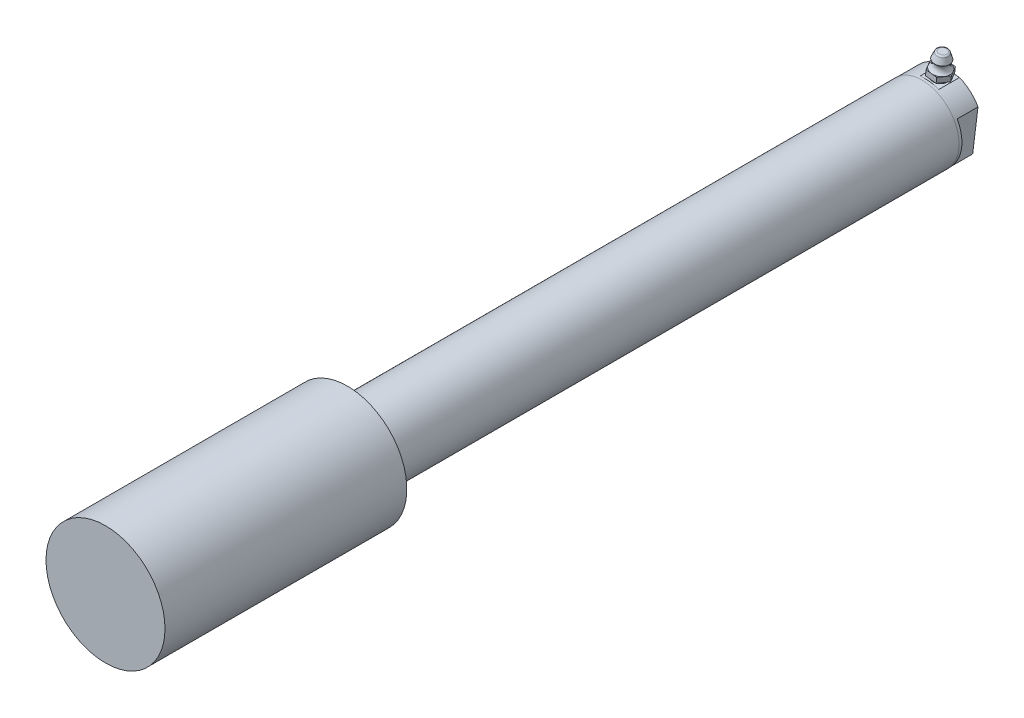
ISO-10303-21;
HEADER;
FILE_DESCRIPTION(('STEP AP214'),'2;1');
FILE_NAME('part.step','',(''),(''),'','','');
FILE_SCHEMA(('AUTOMOTIVE_DESIGN { 1 0 10303 214 1 1 1 1 }'));
ENDSEC;
DATA;
#1=APPLICATION_CONTEXT('core data for automotive mechanical design processes');
#2=APPLICATION_PROTOCOL_DEFINITION('international standard','automotive_design',2000,#1);
#3=PRODUCT_CONTEXT('',#1,'mechanical');
#4=PRODUCT('Part','Part','',(#3));
#5=PRODUCT_RELATED_PRODUCT_CATEGORY('part','',(#4));
#6=PRODUCT_DEFINITION_FORMATION('','',#4);
#7=PRODUCT_DEFINITION_CONTEXT('part definition',#1,'design');
#8=PRODUCT_DEFINITION('design','',#6,#7);
#9=PRODUCT_DEFINITION_SHAPE('','',#8);
#10=(LENGTH_UNIT() NAMED_UNIT(*) SI_UNIT(.MILLI.,.METRE.));
#11=(NAMED_UNIT(*) PLANE_ANGLE_UNIT() SI_UNIT($,.RADIAN.));
#12=(NAMED_UNIT(*) SI_UNIT($,.STERADIAN.) SOLID_ANGLE_UNIT());
#13=UNCERTAINTY_MEASURE_WITH_UNIT(LENGTH_MEASURE(1.E-05),#10,'distance_accuracy_value','');
#14=(GEOMETRIC_REPRESENTATION_CONTEXT(3) GLOBAL_UNCERTAINTY_ASSIGNED_CONTEXT((#13)) GLOBAL_UNIT_ASSIGNED_CONTEXT((#10,
#11,#12)) REPRESENTATION_CONTEXT('',''));
#15=CARTESIAN_POINT('',(0.,0.,0.));
#16=DIRECTION('',(0.,0.,1.));
#17=DIRECTION('',(1.,0.,0.));
#18=AXIS2_PLACEMENT_3D('',#15,#16,#17);
#19=CARTESIAN_POINT('',(0.,0.,10.16));
#20=DIRECTION('',(0.,0.,-1.));
#21=DIRECTION('',(-1.,0.,0.));
#22=AXIS2_PLACEMENT_3D('',#19,#20,#21);
#23=PLANE('',#22);
#24=CARTESIAN_POINT('',(0.,0.,10.16));
#25=DIRECTION('',(0.,0.,-1.));
#26=DIRECTION('',(-1.,0.,0.));
#27=AXIS2_PLACEMENT_3D('',#24,#25,#26);
#28=CIRCLE('',#27,15.8496);
#29=CARTESIAN_POINT('',(-15.8496,0.,10.16));
#30=VERTEX_POINT('',#29);
#31=EDGE_CURVE('E233',#30,#30,#28,.T.);
#32=ORIENTED_EDGE('',*,*,#31,.T.);
#33=EDGE_LOOP('',(#32));
#34=FACE_BOUND('',#33,.T.);
#35=CARTESIAN_POINT('',(0.,0.,10.16));
#36=DIRECTION('',(0.,0.,-1.));
#37=DIRECTION('',(0.,1.,0.));
#38=AXIS2_PLACEMENT_3D('',#35,#36,#37);
#39=CIRCLE('',#38,15.7607);
#40=CARTESIAN_POINT('',(0.,15.7607,10.16));
#41=VERTEX_POINT('',#40);
#42=EDGE_CURVE('E239',#41,#41,#39,.T.);
#43=ORIENTED_EDGE('',*,*,#42,.F.);
#44=EDGE_LOOP('',(#43));
#45=FACE_BOUND('',#44,.T.);
#46=ADVANCED_FACE('F16',(#34,#45),#23,.T.);
#47=CARTESIAN_POINT('',(0.,0.,267.9446));
#48=DIRECTION('',(0.,0.,-1.));
#49=DIRECTION('',(-1.,0.,0.));
#50=AXIS2_PLACEMENT_3D('',#47,#48,#49);
#51=CYLINDRICAL_SURFACE('',#50,15.8496);
#52=CARTESIAN_POINT('',(0.,0.,255.4986));
#53=DIRECTION('',(0.,0.,-1.));
#54=DIRECTION('',(-1.,0.,0.));
#55=AXIS2_PLACEMENT_3D('',#52,#53,#54);
#56=CIRCLE('',#55,15.8496);
#57=CARTESIAN_POINT('',(-15.8496,0.,255.4986));
#58=VERTEX_POINT('',#57);
#59=EDGE_CURVE('E236',#58,#58,#56,.F.);
#60=ORIENTED_EDGE('',*,*,#59,.F.);
#61=EDGE_LOOP('',(#60));
#62=FACE_BOUND('',#61,.T.);
#63=ORIENTED_EDGE('',*,*,#31,.F.);
#64=EDGE_LOOP('',(#63));
#65=FACE_BOUND('',#64,.T.);
#66=ADVANCED_FACE('F373',(#62,#65),#51,.T.);
#67=CARTESIAN_POINT('',(0.,0.,255.4986));
#68=DIRECTION('',(0.,0.,-1.));
#69=DIRECTION('',(-1.,0.,0.));
#70=AXIS2_PLACEMENT_3D('',#67,#68,#69);
#71=PLANE('',#70);
#72=ORIENTED_EDGE('',*,*,#59,.T.);
#73=EDGE_LOOP('',(#72));
#74=FACE_BOUND('',#73,.T.);
#75=CARTESIAN_POINT('',(0.,0.,255.4986));
#76=DIRECTION('',(0.,0.,-1.));
#77=DIRECTION('',(-1.,0.,0.));
#78=AXIS2_PLACEMENT_3D('',#75,#76,#77);
#79=CIRCLE('',#78,25.4);
#80=CARTESIAN_POINT('',(-25.4,0.,255.4986));
#81=VERTEX_POINT('',#80);
#82=EDGE_CURVE('E227',#81,#81,#79,.T.);
#83=ORIENTED_EDGE('',*,*,#82,.T.);
#84=EDGE_LOOP('',(#83));
#85=FACE_BOUND('',#84,.T.);
#86=ADVANCED_FACE('F369',(#74,#85),#71,.T.);
#87=CARTESIAN_POINT('',(0.,0.,358.7496));
#88=DIRECTION('',(0.,0.,1.));
#89=DIRECTION('',(1.,0.,0.));
#90=AXIS2_PLACEMENT_3D('',#87,#88,#89);
#91=PLANE('',#90);
#92=CARTESIAN_POINT('',(0.,0.,358.7496));
#93=DIRECTION('',(0.,0.,1.));
#94=DIRECTION('',(1.,0.,0.));
#95=AXIS2_PLACEMENT_3D('',#92,#93,#94);
#96=CIRCLE('',#95,25.4);
#97=CARTESIAN_POINT('',(25.4,0.,358.7496));
#98=VERTEX_POINT('',#97);
#99=EDGE_CURVE('E230',#98,#98,#96,.T.);
#100=ORIENTED_EDGE('',*,*,#99,.T.);
#101=EDGE_LOOP('',(#100));
#102=FACE_BOUND('',#101,.T.);
#103=ADVANCED_FACE('F372',(#102),#91,.T.);
#104=CARTESIAN_POINT('',(0.,0.,358.7496));
#105=DIRECTION('',(0.,0.,-1.));
#106=DIRECTION('',(-1.,0.,0.));
#107=AXIS2_PLACEMENT_3D('',#104,#105,#106);
#108=CYLINDRICAL_SURFACE('',#107,25.4);
#109=ORIENTED_EDGE('',*,*,#99,.F.);
#110=EDGE_LOOP('',(#109));
#111=FACE_BOUND('',#110,.T.);
#112=ORIENTED_EDGE('',*,*,#82,.F.);
#113=EDGE_LOOP('',(#112));
#114=FACE_BOUND('',#113,.T.);
#115=ADVANCED_FACE('F377',(#111,#114),#108,.T.);
#116=CARTESIAN_POINT('',(0.,0.,32.512));
#117=DIRECTION('',(0.,0.,-1.));
#118=DIRECTION('',(0.121869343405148,0.992546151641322,0.));
#119=AXIS2_PLACEMENT_3D('',#116,#117,#118);
#120=CONICAL_SURFACE('',#119,4.96062,1.02974425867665);
#121=CARTESIAN_POINT('',(0.,0.,35.4926412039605));
#122=VERTEX_POINT('',#121);
#123=VERTEX_LOOP('',#122);
#124=FACE_BOUND('',#123,.T.);
#125=CARTESIAN_POINT('',(0.,0.,32.512));
#126=DIRECTION('',(0.,0.,-1.));
#127=DIRECTION('',(0.121869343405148,0.992546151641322,0.));
#128=AXIS2_PLACEMENT_3D('',#125,#126,#127);
#129=CIRCLE('',#128,4.96062);
#130=CARTESIAN_POINT('',(0.604547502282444,4.92364429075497,32.512));
#131=VERTEX_POINT('',#130);
#132=EDGE_CURVE('E274',#131,#131,#129,.T.);
#133=ORIENTED_EDGE('',*,*,#132,.T.);
#134=EDGE_LOOP('',(#133));
#135=FACE_BOUND('',#134,.T.);
#136=ADVANCED_FACE('F312',(#124,#135),#120,.F.);
#137=CARTESIAN_POINT('',(0.,0.,0.));
#138=DIRECTION('',(0.,0.,-1.));
#139=DIRECTION('',(0.121869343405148,0.992546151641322,0.));
#140=AXIS2_PLACEMENT_3D('',#137,#138,#139);
#141=CYLINDRICAL_SURFACE('',#140,4.96062);
#142=ORIENTED_EDGE('',*,*,#132,.F.);
#143=EDGE_LOOP('',(#142));
#144=FACE_BOUND('',#143,.T.);
#145=CARTESIAN_POINT('',(0.,0.,0.));
#146=DIRECTION('',(0.,0.,-1.));
#147=DIRECTION('',(0.121869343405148,0.992546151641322,0.));
#148=AXIS2_PLACEMENT_3D('',#145,#146,#147);
#149=CIRCLE('',#148,4.96062);
#150=CARTESIAN_POINT('',(0.604547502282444,4.92364429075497,0.));
#151=VERTEX_POINT('',#150);
#152=EDGE_CURVE('E278',#151,#151,#149,.T.);
#153=ORIENTED_EDGE('',*,*,#152,.T.);
#154=EDGE_LOOP('',(#153));
#155=FACE_BOUND('',#154,.T.);
#156=ADVANCED_FACE('F301',(#144,#155),#141,.F.);
#157=CARTESIAN_POINT('',(0.,0.,8.89));
#158=DIRECTION('',(0.,0.,-1.));
#159=DIRECTION('',(0.121869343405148,0.992546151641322,0.));
#160=AXIS2_PLACEMENT_3D('',#157,#158,#159);
#161=PLANE('',#160);
#162=CARTESIAN_POINT('',(0.,0.,8.89));
#163=DIRECTION('',(0.,0.,-1.));
#164=DIRECTION('',(0.121869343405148,0.992546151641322,0.));
#165=AXIS2_PLACEMENT_3D('',#162,#163,#164);
#166=CIRCLE('',#165,15.7607);
#167=CARTESIAN_POINT('',(13.7427738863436,7.71594650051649,8.89));
#168=VERTEX_POINT('',#167);
#169=CARTESIAN_POINT('',(11.467898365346,-10.8114278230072,8.89));
#170=VERTEX_POINT('',#169);
#171=EDGE_CURVE('E263',#168,#170,#166,.T.);
#172=ORIENTED_EDGE('',*,*,#171,.T.);
#173=DIRECTION('',(0.121869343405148,0.992546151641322,0.));
#174=VECTOR('',#173,1.);
#175=CARTESIAN_POINT('',(11.467898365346,-10.8114278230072,8.89));
#176=LINE('',#175,#174);
#177=EDGE_CURVE('E265',#170,#168,#176,.T.);
#178=ORIENTED_EDGE('',*,*,#177,.T.);
#179=EDGE_LOOP('',(#172,#178));
#180=FACE_BOUND('',#179,.T.);
#181=ADVANCED_FACE('F299',(#180),#161,.T.);
#182=CARTESIAN_POINT('',(11.467898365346,-10.8114278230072,8.89));
#183=DIRECTION('',(-0.992546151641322,0.121869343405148,0.));
#184=DIRECTION('',(0.,0.,1.));
#185=AXIS2_PLACEMENT_3D('',#182,#183,#184);
#186=PLANE('',#185);
#187=DIRECTION('',(0.121869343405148,0.992546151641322,0.));
#188=VECTOR('',#187,1.);
#189=CARTESIAN_POINT('',(11.467898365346,-10.8114278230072,0.));
#190=LINE('',#189,#188);
#191=CARTESIAN_POINT('',(11.467898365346,-10.8114278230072,0.));
#192=VERTEX_POINT('',#191);
#193=CARTESIAN_POINT('',(13.7427738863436,7.71594650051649,0.));
#194=VERTEX_POINT('',#193);
#195=EDGE_CURVE('E261',#192,#194,#190,.T.);
#196=ORIENTED_EDGE('',*,*,#195,.T.);
#197=DIRECTION('',(0.,0.,-1.));
#198=VECTOR('',#197,1.);
#199=CARTESIAN_POINT('',(13.7427738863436,7.71594650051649,8.89));
#200=LINE('',#199,#198);
#201=EDGE_CURVE('E271',#168,#194,#200,.T.);
#202=ORIENTED_EDGE('',*,*,#201,.F.);
#203=ORIENTED_EDGE('',*,*,#177,.F.);
#204=DIRECTION('',(0.,0.,-1.));
#205=VECTOR('',#204,1.);
#206=CARTESIAN_POINT('',(11.467898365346,-10.8114278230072,8.89));
#207=LINE('',#206,#205);
#208=EDGE_CURVE('E268',#170,#192,#207,.T.);
#209=ORIENTED_EDGE('',*,*,#208,.T.);
#210=EDGE_LOOP('',(#196,#202,#203,#209));
#211=FACE_BOUND('',#210,.T.);
#212=ADVANCED_FACE('F293',(#211),#186,.F.);
#213=CARTESIAN_POINT('',(0.,0.,8.89));
#214=DIRECTION('',(0.,0.,-1.));
#215=DIRECTION('',(0.121869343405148,0.992546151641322,0.));
#216=AXIS2_PLACEMENT_3D('',#213,#214,#215);
#217=PLANE('',#216);
#218=CARTESIAN_POINT('',(0.,0.,8.89));
#219=DIRECTION('',(0.,0.,-1.));
#220=DIRECTION('',(0.121869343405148,0.992546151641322,0.));
#221=AXIS2_PLACEMENT_3D('',#218,#219,#220);
#222=CIRCLE('',#221,15.7607);
#223=CARTESIAN_POINT('',(-13.7427738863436,-7.71594650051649,8.89));
#224=VERTEX_POINT('',#223);
#225=CARTESIAN_POINT('',(-11.467898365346,10.8114278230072,8.89));
#226=VERTEX_POINT('',#225);
#227=EDGE_CURVE('E252',#224,#226,#222,.T.);
#228=ORIENTED_EDGE('',*,*,#227,.T.);
#229=DIRECTION('',(-0.121869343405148,-0.992546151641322,0.));
#230=VECTOR('',#229,1.);
#231=CARTESIAN_POINT('',(-13.7427738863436,-7.71594650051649,8.89));
#232=LINE('',#231,#230);
#233=EDGE_CURVE('E254',#226,#224,#232,.T.);
#234=ORIENTED_EDGE('',*,*,#233,.T.);
#235=EDGE_LOOP('',(#228,#234));
#236=FACE_BOUND('',#235,.T.);
#237=ADVANCED_FACE('F310',(#236),#217,.T.);
#238=CARTESIAN_POINT('',(-13.7427738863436,-7.71594650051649,8.89));
#239=DIRECTION('',(0.992546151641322,-0.121869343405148,0.));
#240=DIRECTION('',(0.,0.,-1.));
#241=AXIS2_PLACEMENT_3D('',#238,#239,#240);
#242=PLANE('',#241);
#243=DIRECTION('',(-0.121869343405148,-0.992546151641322,0.));
#244=VECTOR('',#243,1.);
#245=CARTESIAN_POINT('',(-13.7427738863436,-7.71594650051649,0.));
#246=LINE('',#245,#244);
#247=CARTESIAN_POINT('',(-11.467898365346,10.8114278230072,0.));
#248=VERTEX_POINT('',#247);
#249=CARTESIAN_POINT('',(-13.7427738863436,-7.71594650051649,0.));
#250=VERTEX_POINT('',#249);
#251=EDGE_CURVE('E249',#248,#250,#246,.T.);
#252=ORIENTED_EDGE('',*,*,#251,.T.);
#253=DIRECTION('',(0.,0.,-1.));
#254=VECTOR('',#253,1.);
#255=CARTESIAN_POINT('',(-13.7427738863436,-7.71594650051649,8.89));
#256=LINE('',#255,#254);
#257=EDGE_CURVE('E258',#224,#250,#256,.T.);
#258=ORIENTED_EDGE('',*,*,#257,.F.);
#259=ORIENTED_EDGE('',*,*,#233,.F.);
#260=DIRECTION('',(0.,0.,-1.));
#261=VECTOR('',#260,1.);
#262=CARTESIAN_POINT('',(-11.467898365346,10.8114278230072,8.89));
#263=LINE('',#262,#261);
#264=EDGE_CURVE('E79',#226,#248,#263,.T.);
#265=ORIENTED_EDGE('',*,*,#264,.T.);
#266=EDGE_LOOP('',(#252,#258,#259,#265));
#267=FACE_BOUND('',#266,.T.);
#268=ADVANCED_FACE('F303',(#267),#242,.F.);
#269=CARTESIAN_POINT('',(0.,0.,0.));
#270=DIRECTION('',(0.,0.,-1.));
#271=DIRECTION('',(0.121869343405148,0.992546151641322,0.));
#272=AXIS2_PLACEMENT_3D('',#269,#270,#271);
#273=PLANE('',#272);
#274=DIRECTION('',(-0.992546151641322,0.121869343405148,0.));
#275=VECTOR('',#274,1.);
#276=CARTESIAN_POINT('',(5.84506014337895,14.636766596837,0.));
#277=LINE('',#276,#275);
#278=CARTESIAN_POINT('',(5.84506014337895,14.636766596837,0.));
#279=VERTEX_POINT('',#278);
#280=CARTESIAN_POINT('',(-2.13048255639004,15.6160401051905,0.));
#281=VERTEX_POINT('',#280);
#282=EDGE_CURVE('E246',#279,#281,#277,.T.);
#283=ORIENTED_EDGE('',*,*,#282,.F.);
#284=CARTESIAN_POINT('',(0.,0.,0.));
#285=DIRECTION('',(0.,0.,-1.));
#286=DIRECTION('',(0.121869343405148,0.992546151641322,0.));
#287=AXIS2_PLACEMENT_3D('',#284,#285,#286);
#288=CIRCLE('',#287,15.7607);
#289=EDGE_CURVE('E280',#279,#194,#288,.T.);
#290=ORIENTED_EDGE('',*,*,#289,.T.);
#291=ORIENTED_EDGE('',*,*,#195,.F.);
#292=EDGE_CURVE('E281',#192,#250,#288,.T.);
#293=ORIENTED_EDGE('',*,*,#292,.T.);
#294=ORIENTED_EDGE('',*,*,#251,.F.);
#295=EDGE_CURVE('E283',#248,#281,#288,.T.);
#296=ORIENTED_EDGE('',*,*,#295,.T.);
#297=EDGE_LOOP('',(#283,#290,#291,#293,#294,#296));
#298=FACE_BOUND('',#297,.T.);
#299=ORIENTED_EDGE('',*,*,#152,.F.);
#300=EDGE_LOOP('',(#299));
#301=FACE_BOUND('',#300,.T.);
#302=ADVANCED_FACE('F289',(#298,#301),#273,.T.);
#303=CARTESIAN_POINT('',(-2.13048255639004,15.6160401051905,8.89));
#304=DIRECTION('',(0.,0.,-1.));
#305=DIRECTION('',(0.121869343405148,0.992546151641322,0.));
#306=AXIS2_PLACEMENT_3D('',#303,#304,#305);
#307=PLANE('',#306);
#308=CARTESIAN_POINT('',(0.,0.,8.89));
#309=DIRECTION('',(0.,0.,-1.));
#310=DIRECTION('',(0.121869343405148,0.992546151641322,0.));
#311=AXIS2_PLACEMENT_3D('',#308,#309,#310);
#312=CIRCLE('',#311,15.7607);
#313=CARTESIAN_POINT('',(5.84506014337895,14.636766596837,8.89));
#314=VERTEX_POINT('',#313);
#315=CARTESIAN_POINT('',(-2.13048255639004,15.6160401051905,8.89));
#316=VERTEX_POINT('',#315);
#317=EDGE_CURVE('E20',#314,#316,#312,.F.);
#318=ORIENTED_EDGE('',*,*,#317,.F.);
#319=DIRECTION('',(-0.992546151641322,0.121869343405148,0.));
#320=VECTOR('',#319,1.);
#321=CARTESIAN_POINT('',(5.84506014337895,14.636766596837,8.89));
#322=LINE('',#321,#320);
#323=EDGE_CURVE('E242',#314,#316,#322,.T.);
#324=ORIENTED_EDGE('',*,*,#323,.T.);
#325=EDGE_LOOP('',(#318,#324));
#326=FACE_BOUND('',#325,.T.);
#327=ADVANCED_FACE('F388',(#326),#307,.T.);
#328=CARTESIAN_POINT('',(5.84506014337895,14.636766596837,8.89));
#329=DIRECTION('',(-0.121869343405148,-0.992546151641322,0.));
#330=DIRECTION('',(0.,0.,-1.));
#331=AXIS2_PLACEMENT_3D('',#328,#329,#330);
#332=PLANE('',#331);
#333=CARTESIAN_POINT('',(1.85728879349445,15.1264033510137,4.445));
#334=DIRECTION('',(-0.121869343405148,-0.992546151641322,0.));
#335=DIRECTION('',(0.992546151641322,-0.121869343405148,0.));
#336=AXIS2_PLACEMENT_3D('',#333,#334,#335);
#337=CIRCLE('',#336,3.21504291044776);
#338=CARTESIAN_POINT('',(5.04836726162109,14.7345881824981,4.445));
#339=VERTEX_POINT('',#338);
#340=EDGE_CURVE('E10',#339,#339,#337,.F.);
#341=ORIENTED_EDGE('',*,*,#340,.F.);
#342=EDGE_LOOP('',(#341));
#343=FACE_BOUND('',#342,.T.);
#344=ORIENTED_EDGE('',*,*,#282,.T.);
#345=DIRECTION('',(0.,0.,-1.));
#346=VECTOR('',#345,1.);
#347=CARTESIAN_POINT('',(-2.13048255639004,15.6160401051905,8.89));
#348=LINE('',#347,#346);
#349=EDGE_CURVE('E245',#316,#281,#348,.T.);
#350=ORIENTED_EDGE('',*,*,#349,.F.);
#351=ORIENTED_EDGE('',*,*,#323,.F.);
#352=DIRECTION('',(0.,0.,-1.));
#353=VECTOR('',#352,1.);
#354=CARTESIAN_POINT('',(5.84506014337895,14.636766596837,8.89));
#355=LINE('',#354,#353);
#356=EDGE_CURVE('E86',#314,#279,#355,.T.);
#357=ORIENTED_EDGE('',*,*,#356,.T.);
#358=EDGE_LOOP('',(#344,#350,#351,#357));
#359=FACE_BOUND('',#358,.T.);
#360=ADVANCED_FACE('F330',(#343,#359),#332,.F.);
#361=CARTESIAN_POINT('',(0.,0.,10.16));
#362=DIRECTION('',(0.,0.,-1.));
#363=DIRECTION('',(0.121869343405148,0.992546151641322,0.));
#364=AXIS2_PLACEMENT_3D('',#361,#362,#363);
#365=CYLINDRICAL_SURFACE('',#364,15.7607);
#366=ORIENTED_EDGE('',*,*,#356,.F.);
#367=ORIENTED_EDGE('',*,*,#317,.T.);
#368=ORIENTED_EDGE('',*,*,#349,.T.);
#369=ORIENTED_EDGE('',*,*,#295,.F.);
#370=ORIENTED_EDGE('',*,*,#264,.F.);
#371=ORIENTED_EDGE('',*,*,#227,.F.);
#372=ORIENTED_EDGE('',*,*,#257,.T.);
#373=ORIENTED_EDGE('',*,*,#292,.F.);
#374=ORIENTED_EDGE('',*,*,#208,.F.);
#375=ORIENTED_EDGE('',*,*,#171,.F.);
#376=ORIENTED_EDGE('',*,*,#201,.T.);
#377=ORIENTED_EDGE('',*,*,#289,.F.);
#378=EDGE_LOOP('',(#366,#367,#368,#369,#370,#371,#372,#373,#374,#375,#376,#377));
#379=FACE_BOUND('',#378,.T.);
#380=ORIENTED_EDGE('',*,*,#42,.T.);
#381=EDGE_LOOP('',(#380));
#382=FACE_BOUND('',#381,.T.);
#383=ADVANCED_FACE('F18',(#379,#382),#365,.T.);
#384=CARTESIAN_POINT('',(3.09548132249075,25.2106722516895,4.445));
#385=DIRECTION('',(0.121869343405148,0.992546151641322,0.));
#386=DIRECTION('',(0.,0.,1.));
#387=AXIS2_PLACEMENT_3D('',#384,#385,#386);
#388=PLANE('',#387);
#389=CARTESIAN_POINT('',(3.09548132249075,25.2106722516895,4.445));
#390=DIRECTION('',(0.121869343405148,0.992546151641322,0.));
#391=DIRECTION('',(0.,0.,1.));
#392=AXIS2_PLACEMENT_3D('',#389,#390,#391);
#393=CIRCLE('',#392,1.7474960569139);
#394=CARTESIAN_POINT('',(3.09548132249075,25.2106722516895,6.1924960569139));
#395=VERTEX_POINT('',#394);
#396=EDGE_CURVE('E26',#395,#395,#393,.T.);
#397=ORIENTED_EDGE('',*,*,#396,.T.);
#398=EDGE_LOOP('',(#397));
#399=FACE_BOUND('',#398,.T.);
#400=ADVANCED_FACE('F317',(#399),#388,.T.);
#401=CARTESIAN_POINT('',(3.00261688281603,24.4543520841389,4.445));
#402=DIRECTION('',(0.121869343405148,0.992546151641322,0.));
#403=DIRECTION('',(0.,0.,1.));
#404=AXIS2_PLACEMENT_3D('',#401,#402,#403);
#405=TOROIDAL_SURFACE('',#404,1.7474960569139,0.762);
#406=ORIENTED_EDGE('',*,*,#396,.F.);
#407=EDGE_LOOP('',(#406));
#408=FACE_BOUND('',#407,.T.);
#409=CARTESIAN_POINT('',(3.03361941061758,24.7068474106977,4.445));
#410=DIRECTION('',(0.121869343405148,0.992546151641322,0.));
#411=DIRECTION('',(0.,0.,1.));
#412=AXIS2_PLACEMENT_3D('',#409,#410,#411);
#413=CIRCLE('',#412,2.46577800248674);
#414=CARTESIAN_POINT('',(3.03361941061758,24.7068474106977,6.91077800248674));
#415=VERTEX_POINT('',#414);
#416=EDGE_CURVE('E222',#415,#415,#413,.F.);
#417=ORIENTED_EDGE('',*,*,#416,.F.);
#418=EDGE_LOOP('',(#417));
#419=FACE_BOUND('',#418,.T.);
#420=ADVANCED_FACE('F319',(#408,#419),#405,.T.);
#421=CARTESIAN_POINT('',(2.72402356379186,22.1853915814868,4.445));
#422=DIRECTION('',(-0.121869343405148,-0.992546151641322,0.));
#423=DIRECTION('',(0.,0.,-1.));
#424=AXIS2_PLACEMENT_3D('',#421,#422,#423);
#425=CONICAL_SURFACE('',#424,3.3655,0.340381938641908);
#426=ORIENTED_EDGE('',*,*,#416,.T.);
#427=EDGE_LOOP('',(#426));
#428=FACE_BOUND('',#427,.T.);
#429=CARTESIAN_POINT('',(2.72402356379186,22.1853915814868,4.445));
#430=DIRECTION('',(-0.121869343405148,-0.992546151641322,0.));
#431=DIRECTION('',(0.,0.,-1.));
#432=AXIS2_PLACEMENT_3D('',#429,#430,#431);
#433=CIRCLE('',#432,3.3655);
#434=CARTESIAN_POINT('',(2.72402356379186,22.1853915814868,1.0795));
#435=VERTEX_POINT('',#434);
#436=EDGE_CURVE('E175',#435,#435,#433,.T.);
#437=ORIENTED_EDGE('',*,*,#436,.F.);
#438=EDGE_LOOP('',(#437));
#439=FACE_BOUND('',#438,.T.);
#440=ADVANCED_FACE('F327',(#428,#439),#425,.T.);
#441=CARTESIAN_POINT('',(2.52923860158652,20.5989953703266,4.445));
#442=DIRECTION('',(-0.121869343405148,-0.992546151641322,0.));
#443=DIRECTION('',(0.,0.,-1.));
#444=AXIS2_PLACEMENT_3D('',#441,#442,#443);
#445=TOROIDAL_SURFACE('',#444,5.20693450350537,2.43833450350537);
#446=ORIENTED_EDGE('',*,*,#436,.T.);
#447=EDGE_LOOP('',(#446));
#448=FACE_BOUND('',#447,.T.);
#449=CARTESIAN_POINT('',(2.27324409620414,18.5140874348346,4.445));
#450=DIRECTION('',(-0.121869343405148,-0.992546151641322,0.));
#451=DIRECTION('',(0.,0.,-1.));
#452=AXIS2_PLACEMENT_3D('',#449,#450,#451);
#453=CIRCLE('',#452,3.96875);
#454=CARTESIAN_POINT('',(2.27324409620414,18.5140874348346,0.47625));
#455=VERTEX_POINT('',#454);
#456=CARTESIAN_POINT('',(5.68466325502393,18.0952178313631,2.460625));
#457=VERTEX_POINT('',#456);
#458=EDGE_CURVE('E35',#455,#457,#453,.T.);
#459=ORIENTED_EDGE('',*,*,#458,.F.);
#460=CARTESIAN_POINT('',(-1.13817506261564,18.932957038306,2.460625));
#461=VERTEX_POINT('',#460);
#462=EDGE_CURVE('E171',#461,#455,#453,.T.);
#463=ORIENTED_EDGE('',*,*,#462,.F.);
#464=CARTESIAN_POINT('',(-1.13817506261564,18.932957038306,6.429375));
#465=VERTEX_POINT('',#464);
#466=EDGE_CURVE('E170',#465,#461,#453,.T.);
#467=ORIENTED_EDGE('',*,*,#466,.F.);
#468=CARTESIAN_POINT('',(2.27324409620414,18.5140874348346,8.41375));
#469=VERTEX_POINT('',#468);
#470=EDGE_CURVE('E150',#469,#465,#453,.T.);
#471=ORIENTED_EDGE('',*,*,#470,.F.);
#472=CARTESIAN_POINT('',(5.68466325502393,18.0952178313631,6.429375));
#473=VERTEX_POINT('',#472);
#474=EDGE_CURVE('E139',#473,#469,#453,.T.);
#475=ORIENTED_EDGE('',*,*,#474,.F.);
#476=EDGE_CURVE('E149',#457,#473,#453,.T.);
#477=ORIENTED_EDGE('',*,*,#476,.F.);
#478=EDGE_LOOP('',(#459,#463,#467,#471,#475,#477));
#479=FACE_BOUND('',#478,.T.);
#480=ADVANCED_FACE('F168',(#448,#479),#445,.F.);
#481=CARTESIAN_POINT('',(-0.00103534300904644,18.7933338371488,0.47625));
#482=DIRECTION('',(0.121869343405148,0.992546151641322,0.));
#483=DIRECTION('',(0.992546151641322,-0.121869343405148,0.));
#484=AXIS2_PLACEMENT_3D('',#481,#482,#483);
#485=PLANE('',#484);
#486=ORIENTED_EDGE('',*,*,#466,.T.);
#487=DIRECTION('',(-0.496273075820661,0.0609346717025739,0.866025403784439));
#488=VECTOR('',#487,1.);
#489=CARTESIAN_POINT('',(-0.00103534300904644,18.7933338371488,0.47625));
#490=LINE('',#489,#488);
#491=CARTESIAN_POINT('',(-2.27531478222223,19.0725802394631,4.445));
#492=VERTEX_POINT('',#491);
#493=EDGE_CURVE('E184',#461,#492,#490,.T.);
#494=ORIENTED_EDGE('',*,*,#493,.T.);
#495=DIRECTION('',(0.496273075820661,-0.0609346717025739,0.866025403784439));
#496=VECTOR('',#495,1.);
#497=CARTESIAN_POINT('',(-2.27531478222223,19.0725802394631,4.445));
#498=LINE('',#497,#496);
#499=EDGE_CURVE('E95',#492,#465,#498,.T.);
#500=ORIENTED_EDGE('',*,*,#499,.T.);
#501=EDGE_LOOP('',(#486,#494,#500));
#502=FACE_BOUND('',#501,.T.);
#503=ADVANCED_FACE('F338',(#502),#485,.T.);
#504=ORIENTED_EDGE('',*,*,#470,.T.);
#505=CARTESIAN_POINT('',(-0.00103534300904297,18.7933338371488,8.41375));
#506=VERTEX_POINT('',#505);
#507=EDGE_CURVE('E165',#465,#506,#498,.T.);
#508=ORIENTED_EDGE('',*,*,#507,.T.);
#509=DIRECTION('',(0.992546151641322,-0.121869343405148,0.));
#510=VECTOR('',#509,1.);
#511=CARTESIAN_POINT('',(-0.00103534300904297,18.7933338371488,8.41375));
#512=LINE('',#511,#510);
#513=EDGE_CURVE('E157',#506,#469,#512,.T.);
#514=ORIENTED_EDGE('',*,*,#513,.T.);
#515=EDGE_LOOP('',(#504,#508,#514));
#516=FACE_BOUND('',#515,.T.);
#517=ADVANCED_FACE('F163',(#516),#485,.T.);
#518=ORIENTED_EDGE('',*,*,#474,.T.);
#519=CARTESIAN_POINT('',(4.54752353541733,18.2348410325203,8.41375));
#520=VERTEX_POINT('',#519);
#521=EDGE_CURVE('E142',#469,#520,#512,.T.);
#522=ORIENTED_EDGE('',*,*,#521,.T.);
#523=DIRECTION('',(0.496273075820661,-0.0609346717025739,-0.866025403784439));
#524=VECTOR('',#523,1.);
#525=CARTESIAN_POINT('',(4.54752353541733,18.2348410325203,8.41375));
#526=LINE('',#525,#524);
#527=EDGE_CURVE('E145',#520,#473,#526,.T.);
#528=ORIENTED_EDGE('',*,*,#527,.T.);
#529=EDGE_LOOP('',(#518,#522,#528));
#530=FACE_BOUND('',#529,.T.);
#531=ADVANCED_FACE('F141',(#530),#485,.T.);
#532=ORIENTED_EDGE('',*,*,#476,.T.);
#533=CARTESIAN_POINT('',(6.82180297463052,17.9555946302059,4.445));
#534=VERTEX_POINT('',#533);
#535=EDGE_CURVE('E167',#473,#534,#526,.T.);
#536=ORIENTED_EDGE('',*,*,#535,.T.);
#537=DIRECTION('',(-0.496273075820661,0.0609346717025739,-0.866025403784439));
#538=VECTOR('',#537,1.);
#539=CARTESIAN_POINT('',(6.82180297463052,17.9555946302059,4.445));
#540=LINE('',#539,#538);
#541=EDGE_CURVE('E192',#534,#457,#540,.T.);
#542=ORIENTED_EDGE('',*,*,#541,.T.);
#543=EDGE_LOOP('',(#532,#536,#542));
#544=FACE_BOUND('',#543,.T.);
#545=ADVANCED_FACE('F624',(#544),#485,.T.);
#546=ORIENTED_EDGE('',*,*,#458,.T.);
#547=CARTESIAN_POINT('',(4.54752353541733,18.2348410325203,0.47625));
#548=VERTEX_POINT('',#547);
#549=EDGE_CURVE('E191',#457,#548,#540,.T.);
#550=ORIENTED_EDGE('',*,*,#549,.T.);
#551=DIRECTION('',(-0.992546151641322,0.121869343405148,0.));
#552=VECTOR('',#551,1.);
#553=CARTESIAN_POINT('',(4.54752353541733,18.2348410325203,0.47625));
#554=LINE('',#553,#552);
#555=EDGE_CURVE('E182',#548,#455,#554,.T.);
#556=ORIENTED_EDGE('',*,*,#555,.T.);
#557=EDGE_LOOP('',(#546,#550,#556));
#558=FACE_BOUND('',#557,.T.);
#559=ADVANCED_FACE('F631',(#558),#485,.T.);
#560=ORIENTED_EDGE('',*,*,#462,.T.);
#561=CARTESIAN_POINT('',(-0.00103534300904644,18.7933338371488,0.47625));
#562=VERTEX_POINT('',#561);
#563=EDGE_CURVE('E185',#455,#562,#554,.T.);
#564=ORIENTED_EDGE('',*,*,#563,.T.);
#565=EDGE_CURVE('E186',#562,#461,#490,.T.);
#566=ORIENTED_EDGE('',*,*,#565,.T.);
#567=EDGE_LOOP('',(#560,#564,#566));
#568=FACE_BOUND('',#567,.T.);
#569=ADVANCED_FACE('F341',(#568),#485,.T.);
#570=CARTESIAN_POINT('',(-0.00103534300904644,18.7933338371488,0.47625));
#571=DIRECTION('',(0.859570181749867,-0.105541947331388,0.5));
#572=DIRECTION('',(0.496273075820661,-0.0609346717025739,-0.866025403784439));
#573=AXIS2_PLACEMENT_3D('',#570,#571,#572);
#574=PLANE('',#573);
#575=DIRECTION('',(-0.496273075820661,0.0609346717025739,0.866025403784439));
#576=VECTOR('',#575,1.);
#577=CARTESIAN_POINT('',(-0.291236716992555,16.4298333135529,0.47625));
#578=LINE('',#577,#576);
#579=CARTESIAN_POINT('',(-0.291236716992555,16.4298333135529,0.47625));
#580=VERTEX_POINT('',#579);
#581=CARTESIAN_POINT('',(-2.56551615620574,16.7090797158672,4.445));
#582=VERTEX_POINT('',#581);
#583=EDGE_CURVE('E198',#580,#582,#578,.T.);
#584=ORIENTED_EDGE('',*,*,#583,.T.);
#585=DIRECTION('',(-0.121869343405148,-0.992546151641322,0.));
#586=VECTOR('',#585,1.);
#587=CARTESIAN_POINT('',(-2.27531478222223,19.0725802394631,4.445));
#588=LINE('',#587,#586);
#589=EDGE_CURVE('E216',#492,#582,#588,.T.);
#590=ORIENTED_EDGE('',*,*,#589,.F.);
#591=ORIENTED_EDGE('',*,*,#493,.F.);
#592=ORIENTED_EDGE('',*,*,#565,.F.);
#593=DIRECTION('',(-0.121869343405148,-0.992546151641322,0.));
#594=VECTOR('',#593,1.);
#595=CARTESIAN_POINT('',(-0.00103534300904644,18.7933338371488,0.47625));
#596=LINE('',#595,#594);
#597=EDGE_CURVE('E219',#562,#580,#596,.T.);
#598=ORIENTED_EDGE('',*,*,#597,.T.);
#599=EDGE_LOOP('',(#584,#590,#591,#592,#598));
#600=FACE_BOUND('',#599,.T.);
#601=ADVANCED_FACE('F361',(#600),#574,.F.);
#602=CARTESIAN_POINT('',(-2.27531478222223,19.0725802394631,4.445));
#603=DIRECTION('',(0.859570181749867,-0.105541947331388,-0.5));
#604=DIRECTION('',(-0.496273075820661,0.0609346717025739,-0.866025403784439));
#605=AXIS2_PLACEMENT_3D('',#602,#603,#604);
#606=PLANE('',#605);
#607=DIRECTION('',(0.496273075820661,-0.0609346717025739,0.866025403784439));
#608=VECTOR('',#607,1.);
#609=CARTESIAN_POINT('',(-2.56551615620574,16.7090797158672,4.445));
#610=LINE('',#609,#608);
#611=CARTESIAN_POINT('',(-0.291236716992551,16.4298333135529,8.41375));
#612=VERTEX_POINT('',#611);
#613=EDGE_CURVE('E200',#582,#612,#610,.T.);
#614=ORIENTED_EDGE('',*,*,#613,.T.);
#615=DIRECTION('',(-0.121869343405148,-0.992546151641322,0.));
#616=VECTOR('',#615,1.);
#617=CARTESIAN_POINT('',(-0.00103534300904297,18.7933338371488,8.41375));
#618=LINE('',#617,#616);
#619=EDGE_CURVE('E214',#506,#612,#618,.T.);
#620=ORIENTED_EDGE('',*,*,#619,.F.);
#621=ORIENTED_EDGE('',*,*,#507,.F.);
#622=ORIENTED_EDGE('',*,*,#499,.F.);
#623=ORIENTED_EDGE('',*,*,#589,.T.);
#624=EDGE_LOOP('',(#614,#620,#621,#622,#623));
#625=FACE_BOUND('',#624,.T.);
#626=ADVANCED_FACE('F358',(#625),#606,.F.);
#627=CARTESIAN_POINT('',(-0.00103534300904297,18.7933338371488,8.41375));
#628=DIRECTION('',(0.,0.,-1.));
#629=DIRECTION('',(-0.992546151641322,0.121869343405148,0.));
#630=AXIS2_PLACEMENT_3D('',#627,#628,#629);
#631=PLANE('',#630);
#632=DIRECTION('',(0.992546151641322,-0.121869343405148,0.));
#633=VECTOR('',#632,1.);
#634=CARTESIAN_POINT('',(-0.291236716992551,16.4298333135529,8.41375));
#635=LINE('',#634,#633);
#636=CARTESIAN_POINT('',(4.25732216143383,15.8713405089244,8.41375));
#637=VERTEX_POINT('',#636);
#638=EDGE_CURVE('E202',#612,#637,#635,.T.);
#639=ORIENTED_EDGE('',*,*,#638,.T.);
#640=DIRECTION('',(-0.121869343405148,-0.992546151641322,0.));
#641=VECTOR('',#640,1.);
#642=CARTESIAN_POINT('',(4.54752353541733,18.2348410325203,8.41375));
#643=LINE('',#642,#641);
#644=EDGE_CURVE('E159',#520,#637,#643,.T.);
#645=ORIENTED_EDGE('',*,*,#644,.F.);
#646=ORIENTED_EDGE('',*,*,#521,.F.);
#647=ORIENTED_EDGE('',*,*,#513,.F.);
#648=ORIENTED_EDGE('',*,*,#619,.T.);
#649=EDGE_LOOP('',(#639,#645,#646,#647,#648));
#650=FACE_BOUND('',#649,.T.);
#651=ADVANCED_FACE('F155',(#650),#631,.F.);
#652=CARTESIAN_POINT('',(4.54752353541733,18.2348410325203,8.41375));
#653=DIRECTION('',(-0.859570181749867,0.105541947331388,-0.5));
#654=DIRECTION('',(-0.496273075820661,0.0609346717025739,0.866025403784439));
#655=AXIS2_PLACEMENT_3D('',#652,#653,#654);
#656=PLANE('',#655);
#657=DIRECTION('',(0.496273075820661,-0.0609346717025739,-0.866025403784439));
#658=VECTOR('',#657,1.);
#659=CARTESIAN_POINT('',(4.25732216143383,15.8713405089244,8.41375));
#660=LINE('',#659,#658);
#661=CARTESIAN_POINT('',(6.53160160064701,15.5920941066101,4.445));
#662=VERTEX_POINT('',#661);
#663=EDGE_CURVE('E204',#637,#662,#660,.T.);
#664=ORIENTED_EDGE('',*,*,#663,.T.);
#665=DIRECTION('',(-0.121869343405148,-0.992546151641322,0.));
#666=VECTOR('',#665,1.);
#667=CARTESIAN_POINT('',(6.82180297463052,17.9555946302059,4.445));
#668=LINE('',#667,#666);
#669=EDGE_CURVE('E210',#534,#662,#668,.T.);
#670=ORIENTED_EDGE('',*,*,#669,.F.);
#671=ORIENTED_EDGE('',*,*,#535,.F.);
#672=ORIENTED_EDGE('',*,*,#527,.F.);
#673=ORIENTED_EDGE('',*,*,#644,.T.);
#674=EDGE_LOOP('',(#664,#670,#671,#672,#673));
#675=FACE_BOUND('',#674,.T.);
#676=ADVANCED_FACE('F351',(#675),#656,.F.);
#677=CARTESIAN_POINT('',(6.82180297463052,17.9555946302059,4.445));
#678=DIRECTION('',(-0.859570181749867,0.105541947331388,0.5));
#679=DIRECTION('',(0.496273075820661,-0.0609346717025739,0.866025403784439));
#680=AXIS2_PLACEMENT_3D('',#677,#678,#679);
#681=PLANE('',#680);
#682=DIRECTION('',(-0.496273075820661,0.0609346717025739,-0.866025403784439));
#683=VECTOR('',#682,1.);
#684=CARTESIAN_POINT('',(6.53160160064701,15.5920941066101,4.445));
#685=LINE('',#684,#683);
#686=CARTESIAN_POINT('',(4.25732216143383,15.8713405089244,0.47625));
#687=VERTEX_POINT('',#686);
#688=EDGE_CURVE('E206',#662,#687,#685,.T.);
#689=ORIENTED_EDGE('',*,*,#688,.T.);
#690=DIRECTION('',(-0.121869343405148,-0.992546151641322,0.));
#691=VECTOR('',#690,1.);
#692=CARTESIAN_POINT('',(4.54752353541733,18.2348410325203,0.47625));
#693=LINE('',#692,#691);
#694=EDGE_CURVE('E195',#548,#687,#693,.T.);
#695=ORIENTED_EDGE('',*,*,#694,.F.);
#696=ORIENTED_EDGE('',*,*,#549,.F.);
#697=ORIENTED_EDGE('',*,*,#541,.F.);
#698=ORIENTED_EDGE('',*,*,#669,.T.);
#699=EDGE_LOOP('',(#689,#695,#696,#697,#698));
#700=FACE_BOUND('',#699,.T.);
#701=ADVANCED_FACE('F348',(#700),#681,.F.);
#702=CARTESIAN_POINT('',(4.54752353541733,18.2348410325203,0.47625));
#703=DIRECTION('',(0.,0.,1.));
#704=DIRECTION('',(-0.121869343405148,-0.992546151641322,0.));
#705=AXIS2_PLACEMENT_3D('',#702,#703,#704);
#706=PLANE('',#705);
#707=DIRECTION('',(-0.992546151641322,0.121869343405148,0.));
#708=VECTOR('',#707,1.);
#709=CARTESIAN_POINT('',(4.25732216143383,15.8713405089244,0.47625));
#710=LINE('',#709,#708);
#711=EDGE_CURVE('E181',#687,#580,#710,.T.);
#712=ORIENTED_EDGE('',*,*,#711,.T.);
#713=ORIENTED_EDGE('',*,*,#597,.F.);
#714=ORIENTED_EDGE('',*,*,#563,.F.);
#715=ORIENTED_EDGE('',*,*,#555,.F.);
#716=ORIENTED_EDGE('',*,*,#694,.T.);
#717=EDGE_LOOP('',(#712,#713,#714,#715,#716));
#718=FACE_BOUND('',#717,.T.);
#719=ADVANCED_FACE('F346',(#718),#706,.F.);
#720=CARTESIAN_POINT('',(-0.291236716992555,16.4298333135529,0.47625));
#721=DIRECTION('',(0.121869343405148,0.992546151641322,0.));
#722=DIRECTION('',(0.992546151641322,-0.121869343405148,0.));
#723=AXIS2_PLACEMENT_3D('',#720,#721,#722);
#724=PLANE('',#723);
#725=CARTESIAN_POINT('',(1.98304272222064,16.1505869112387,4.445));
#726=DIRECTION('',(-0.121869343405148,-0.992546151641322,0.));
#727=DIRECTION('',(0.,0.,-1.));
#728=AXIS2_PLACEMENT_3D('',#725,#726,#727);
#729=CIRCLE('',#728,3.2385);
#730=CARTESIAN_POINT('',(1.98304272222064,16.1505869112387,1.2065));
#731=VERTEX_POINT('',#730);
#732=EDGE_CURVE('E174',#731,#731,#729,.T.);
#733=ORIENTED_EDGE('',*,*,#732,.F.);
#734=EDGE_LOOP('',(#733));
#735=FACE_BOUND('',#734,.T.);
#736=ORIENTED_EDGE('',*,*,#711,.F.);
#737=ORIENTED_EDGE('',*,*,#688,.F.);
#738=ORIENTED_EDGE('',*,*,#663,.F.);
#739=ORIENTED_EDGE('',*,*,#638,.F.);
#740=ORIENTED_EDGE('',*,*,#613,.F.);
#741=ORIENTED_EDGE('',*,*,#583,.F.);
#742=EDGE_LOOP('',(#736,#737,#738,#739,#740,#741));
#743=FACE_BOUND('',#742,.T.);
#744=ADVANCED_FACE('F342',(#735,#743),#724,.F.);
#745=CARTESIAN_POINT('',(1.98304272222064,16.1505869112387,4.445));
#746=DIRECTION('',(-0.121869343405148,-0.992546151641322,0.));
#747=DIRECTION('',(0.,0.,-1.));
#748=AXIS2_PLACEMENT_3D('',#745,#746,#747);
#749=CYLINDRICAL_SURFACE('',#748,3.2385);
#750=ORIENTED_EDGE('',*,*,#732,.T.);
#751=EDGE_LOOP('',(#750));
#752=FACE_BOUND('',#751,.T.);
#753=CARTESIAN_POINT('',(1.92113309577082,15.6463734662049,4.445));
#754=DIRECTION('',(-0.121869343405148,-0.992546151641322,0.));
#755=DIRECTION('',(0.,0.,-1.));
#756=AXIS2_PLACEMENT_3D('',#753,#754,#755);
#757=CIRCLE('',#756,3.2385);
#758=CARTESIAN_POINT('',(1.92113309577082,15.6463734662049,1.2065));
#759=VERTEX_POINT('',#758);
#760=EDGE_CURVE('E178',#759,#759,#757,.T.);
#761=ORIENTED_EDGE('',*,*,#760,.F.);
#762=EDGE_LOOP('',(#761));
#763=FACE_BOUND('',#762,.T.);
#764=ADVANCED_FACE('F345',(#752,#763),#749,.T.);
#765=CARTESIAN_POINT('',(1.40263997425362,11.4235858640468,4.445));
#766=DIRECTION('',(0.121869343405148,0.992546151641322,0.));
#767=DIRECTION('',(0.,0.,1.));
#768=AXIS2_PLACEMENT_3D('',#765,#766,#767);
#769=CONICAL_SURFACE('',#768,3.048,0.0447462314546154);
#770=ORIENTED_EDGE('',*,*,#760,.T.);
#771=EDGE_LOOP('',(#770));
#772=FACE_BOUND('',#771,.T.);
#773=ORIENTED_EDGE('',*,*,#340,.T.);
#774=EDGE_LOOP('',(#773));
#775=FACE_BOUND('',#774,.T.);
#776=ADVANCED_FACE('F333',(#772,#775),#769,.T.);
#777=CLOSED_SHELL('',(#46,#66,#86,#103,#115,#136,#156,#181,#212,#237,#268,#302,#327,#360,#383,
#400,#420,#440,#480,#503,#517,#531,#545,#559,#569,#601,#626,#651,#676,#701,#719,#744,#764,#776));
#778=MANIFOLD_SOLID_BREP('B1',#777);
#779=ADVANCED_BREP_SHAPE_REPRESENTATION('',(#18,#778),#14);
#780=SHAPE_DEFINITION_REPRESENTATION(#9,#779);
ENDSEC;
END-ISO-10303-21;
